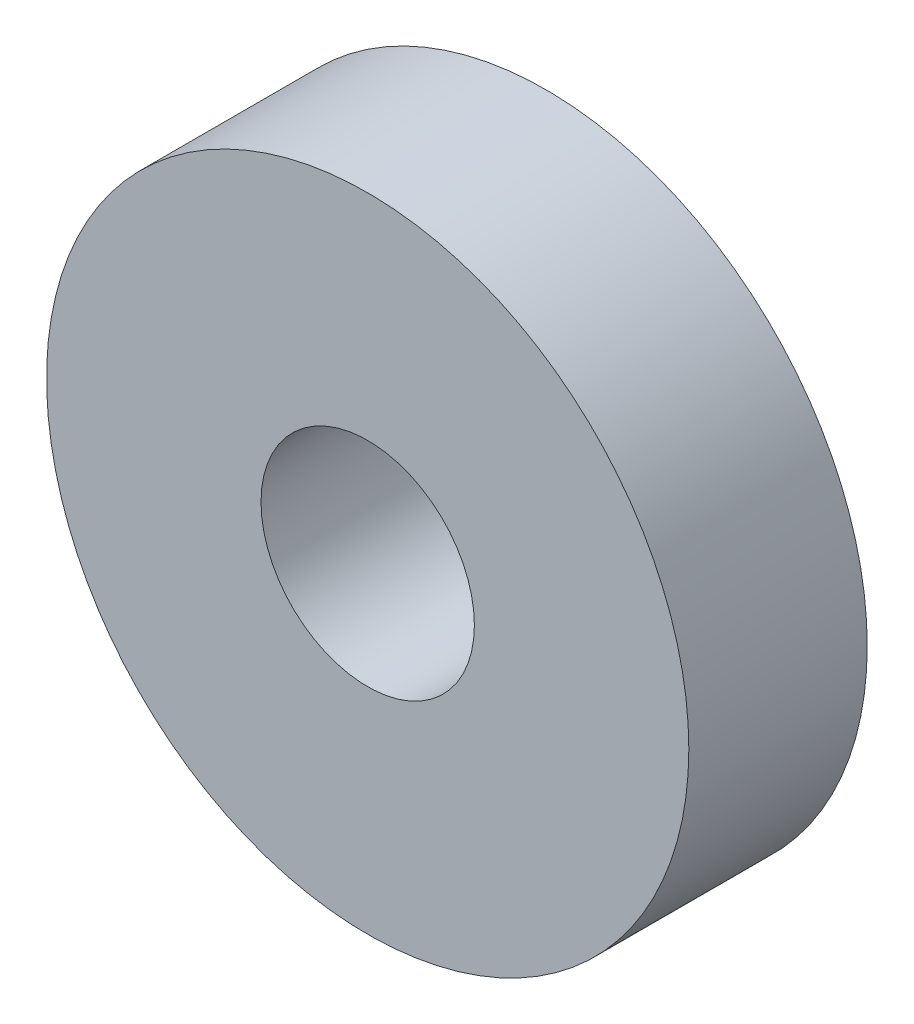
from build123d import *

# Parameters (mm, degrees)
SKETCH2_R           = 5.715
SKETCH2_R_2         = 1.89865
BOSS_EXTRUDE1_DEPTH = 3.175


with BuildPart() as part:
    # Sketch2 → Boss-Extrude1 (new body)
    with BuildSketch(Plane.XY):
        Circle(SKETCH2_R)
        Circle(SKETCH2_R_2, mode=Mode.SUBTRACT)
    extrude(amount=BOSS_EXTRUDE1_DEPTH)


solid = part.part
